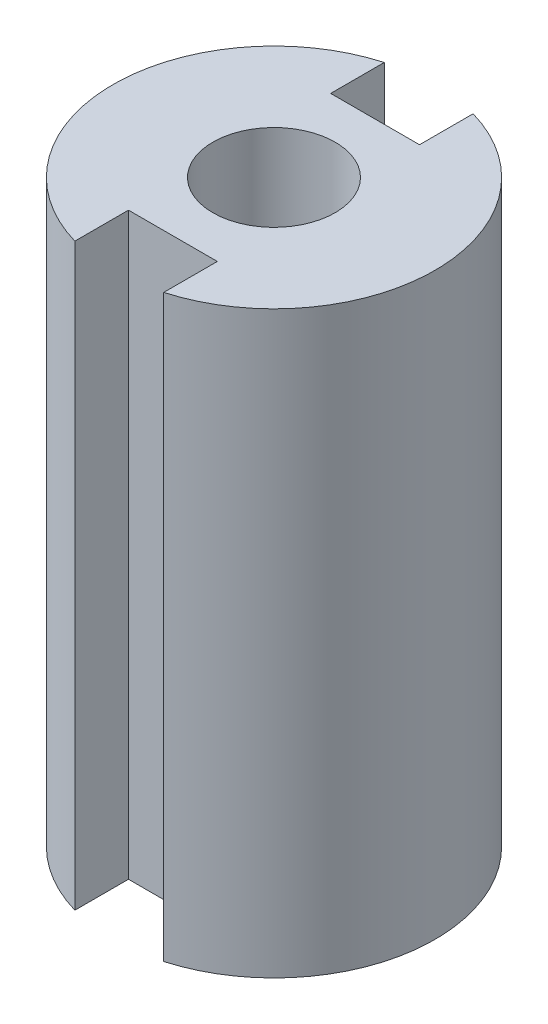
ISO-10303-21;
HEADER;
FILE_DESCRIPTION(('STEP AP214'),'2;1');
FILE_NAME('part.step','',(''),(''),'','','');
FILE_SCHEMA(('AUTOMOTIVE_DESIGN { 1 0 10303 214 1 1 1 1 }'));
ENDSEC;
DATA;
#1=APPLICATION_CONTEXT('core data for automotive mechanical design processes');
#2=APPLICATION_PROTOCOL_DEFINITION('international standard','automotive_design',2000,#1);
#3=PRODUCT_CONTEXT('',#1,'mechanical');
#4=PRODUCT('Part','Part','',(#3));
#5=PRODUCT_RELATED_PRODUCT_CATEGORY('part','',(#4));
#6=PRODUCT_DEFINITION_FORMATION('','',#4);
#7=PRODUCT_DEFINITION_CONTEXT('part definition',#1,'design');
#8=PRODUCT_DEFINITION('design','',#6,#7);
#9=PRODUCT_DEFINITION_SHAPE('','',#8);
#10=(LENGTH_UNIT() NAMED_UNIT(*) SI_UNIT(.MILLI.,.METRE.));
#11=(NAMED_UNIT(*) PLANE_ANGLE_UNIT() SI_UNIT($,.RADIAN.));
#12=(NAMED_UNIT(*) SI_UNIT($,.STERADIAN.) SOLID_ANGLE_UNIT());
#13=UNCERTAINTY_MEASURE_WITH_UNIT(LENGTH_MEASURE(1.E-05),#10,'distance_accuracy_value','');
#14=(GEOMETRIC_REPRESENTATION_CONTEXT(3) GLOBAL_UNCERTAINTY_ASSIGNED_CONTEXT((#13)) GLOBAL_UNIT_ASSIGNED_CONTEXT((#10,
#11,#12)) REPRESENTATION_CONTEXT('',''));
#15=CARTESIAN_POINT('',(0.,0.,0.));
#16=DIRECTION('',(0.,0.,1.));
#17=DIRECTION('',(1.,0.,0.));
#18=AXIS2_PLACEMENT_3D('',#15,#16,#17);
#19=CARTESIAN_POINT('',(0.,22.8599999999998,0.));
#20=DIRECTION('',(0.,-1.,0.));
#21=DIRECTION('',(0.,0.,-1.00000000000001));
#22=AXIS2_PLACEMENT_3D('',#19,#20,#21);
#23=CYLINDRICAL_SURFACE('',#22,6.35);
#24=CARTESIAN_POINT('',(0.,22.8599999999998,0.));
#25=DIRECTION('',(0.,1.,0.));
#26=DIRECTION('',(0.,0.,1.00000000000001));
#27=AXIS2_PLACEMENT_3D('',#24,#25,#26);
#28=CIRCLE('',#27,6.35);
#29=CARTESIAN_POINT('',(-1.75260000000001,22.8600000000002,-6.10335098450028));
#30=VERTEX_POINT('',#29);
#31=CARTESIAN_POINT('',(-1.75260000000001,22.86,6.10335098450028));
#32=VERTEX_POINT('',#31);
#33=EDGE_CURVE('E167',#30,#32,#28,.T.);
#34=ORIENTED_EDGE('',*,*,#33,.F.);
#35=DIRECTION('',(0.,-1.,0.));
#36=VECTOR('',#35,1.);
#37=CARTESIAN_POINT('',(-1.75260000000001,22.8600000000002,-6.10335098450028));
#38=LINE('',#37,#36);
#39=CARTESIAN_POINT('',(-1.75260000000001,2.28983498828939E-13,-6.10335098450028));
#40=VERTEX_POINT('',#39);
#41=EDGE_CURVE('E127',#30,#40,#38,.T.);
#42=ORIENTED_EDGE('',*,*,#41,.T.);
#43=CARTESIAN_POINT('',(0.,-2.22044604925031E-13,0.));
#44=DIRECTION('',(0.,1.,0.));
#45=DIRECTION('',(0.,0.,1.00000000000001));
#46=AXIS2_PLACEMENT_3D('',#43,#44,#45);
#47=CIRCLE('',#46,6.35);
#48=CARTESIAN_POINT('',(-1.75260000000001,0.,6.10335098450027));
#49=VERTEX_POINT('',#48);
#50=EDGE_CURVE('E163',#40,#49,#47,.T.);
#51=ORIENTED_EDGE('',*,*,#50,.T.);
#52=DIRECTION('',(0.,-1.,0.));
#53=VECTOR('',#52,1.);
#54=CARTESIAN_POINT('',(-1.75260000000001,22.86,6.10335098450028));
#55=LINE('',#54,#53);
#56=EDGE_CURVE('E145',#49,#32,#55,.F.);
#57=ORIENTED_EDGE('',*,*,#56,.T.);
#58=EDGE_LOOP('',(#34,#42,#51,#57));
#59=FACE_BOUND('',#58,.T.);
#60=ADVANCED_FACE('F30',(#59),#23,.T.);
#61=CARTESIAN_POINT('',(1.75259999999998,-2.22044604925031E-13,6.10335098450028));
#62=VERTEX_POINT('',#61);
#63=CARTESIAN_POINT('',(1.75259999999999,0.,-6.10335098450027));
#64=VERTEX_POINT('',#63);
#65=EDGE_CURVE('E164',#62,#64,#47,.T.);
#66=ORIENTED_EDGE('',*,*,#65,.T.);
#67=DIRECTION('',(0.,-1.,0.));
#68=VECTOR('',#67,1.);
#69=CARTESIAN_POINT('',(1.75259999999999,22.8600000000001,-6.10335098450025));
#70=LINE('',#69,#68);
#71=CARTESIAN_POINT('',(1.75259999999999,22.8600000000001,-6.10335098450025));
#72=VERTEX_POINT('',#71);
#73=EDGE_CURVE('E45',#64,#72,#70,.F.);
#74=ORIENTED_EDGE('',*,*,#73,.T.);
#75=CARTESIAN_POINT('',(1.75260000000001,22.86,6.10335098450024));
#76=VERTEX_POINT('',#75);
#77=EDGE_CURVE('E117',#76,#72,#28,.T.);
#78=ORIENTED_EDGE('',*,*,#77,.F.);
#79=DIRECTION('',(0.,-1.,0.));
#80=VECTOR('',#79,1.);
#81=CARTESIAN_POINT('',(1.75260000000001,22.86,6.10335098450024));
#82=LINE('',#81,#80);
#83=EDGE_CURVE('E150',#76,#62,#82,.T.);
#84=ORIENTED_EDGE('',*,*,#83,.T.);
#85=EDGE_LOOP('',(#66,#74,#78,#84));
#86=FACE_BOUND('',#85,.T.);
#87=ADVANCED_FACE('F32',(#86),#23,.T.);
#88=CARTESIAN_POINT('',(0.,22.8599999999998,0.));
#89=DIRECTION('',(0.,1.,0.));
#90=DIRECTION('',(0.,0.,1.00000000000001));
#91=AXIS2_PLACEMENT_3D('',#88,#89,#90);
#92=PLANE('',#91);
#93=DIRECTION('',(0.,0.,1.00000000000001));
#94=VECTOR('',#93,1.);
#95=CARTESIAN_POINT('',(-1.75260000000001,22.86,-3.9878));
#96=LINE('',#95,#94);
#97=CARTESIAN_POINT('',(-1.75260000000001,22.86,-3.9878));
#98=VERTEX_POINT('',#97);
#99=EDGE_CURVE('E118',#30,#98,#96,.T.);
#100=ORIENTED_EDGE('',*,*,#99,.F.);
#101=ORIENTED_EDGE('',*,*,#33,.T.);
#102=DIRECTION('',(0.,0.,1.00000000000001));
#103=VECTOR('',#102,1.);
#104=CARTESIAN_POINT('',(-1.75260000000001,22.8599999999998,3.9878));
#105=LINE('',#104,#103);
#106=CARTESIAN_POINT('',(-1.75260000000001,22.8599999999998,3.9878));
#107=VERTEX_POINT('',#106);
#108=EDGE_CURVE('E135',#107,#32,#105,.T.);
#109=ORIENTED_EDGE('',*,*,#108,.F.);
#110=DIRECTION('',(-1.00000000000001,0.,0.));
#111=VECTOR('',#110,1.);
#112=CARTESIAN_POINT('',(-1.75260000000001,22.8599999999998,3.9878));
#113=LINE('',#112,#111);
#114=CARTESIAN_POINT('',(1.75260000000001,22.86,3.98780000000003));
#115=VERTEX_POINT('',#114);
#116=EDGE_CURVE('E132',#115,#107,#113,.T.);
#117=ORIENTED_EDGE('',*,*,#116,.F.);
#118=DIRECTION('',(0.,0.,-1.00000000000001));
#119=VECTOR('',#118,1.);
#120=CARTESIAN_POINT('',(1.75260000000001,22.86,3.98780000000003));
#121=LINE('',#120,#119);
#122=EDGE_CURVE('E130',#76,#115,#121,.T.);
#123=ORIENTED_EDGE('',*,*,#122,.F.);
#124=ORIENTED_EDGE('',*,*,#77,.T.);
#125=DIRECTION('',(0.,0.,-1.00000000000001));
#126=VECTOR('',#125,1.);
#127=CARTESIAN_POINT('',(1.75259999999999,22.86,-3.98780000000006));
#128=LINE('',#127,#126);
#129=CARTESIAN_POINT('',(1.75259999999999,22.86,-3.98780000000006));
#130=VERTEX_POINT('',#129);
#131=EDGE_CURVE('E98',#130,#72,#128,.T.);
#132=ORIENTED_EDGE('',*,*,#131,.F.);
#133=DIRECTION('',(1.00000000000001,0.,0.));
#134=VECTOR('',#133,1.);
#135=CARTESIAN_POINT('',(-1.75260000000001,22.86,-3.9878));
#136=LINE('',#135,#134);
#137=EDGE_CURVE('E107',#98,#130,#136,.T.);
#138=ORIENTED_EDGE('',*,*,#137,.F.);
#139=EDGE_LOOP('',(#100,#101,#109,#117,#123,#124,#132,#138));
#140=FACE_BOUND('',#139,.T.);
#141=CARTESIAN_POINT('',(0.,22.8599999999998,0.));
#142=DIRECTION('',(0.,1.,0.));
#143=DIRECTION('',(0.,0.,1.00000000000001));
#144=AXIS2_PLACEMENT_3D('',#141,#142,#143);
#145=CIRCLE('',#144,2.413);
#146=CARTESIAN_POINT('',(0.,22.8599999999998,2.41300000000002));
#147=VERTEX_POINT('',#146);
#148=EDGE_CURVE('E157',#147,#147,#145,.T.);
#149=ORIENTED_EDGE('',*,*,#148,.F.);
#150=EDGE_LOOP('',(#149));
#151=FACE_BOUND('',#150,.T.);
#152=ADVANCED_FACE('F113',(#140,#151),#92,.T.);
#153=CARTESIAN_POINT('',(0.,-2.22044604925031E-13,0.));
#154=DIRECTION('',(0.,1.,0.));
#155=DIRECTION('',(0.,0.,1.00000000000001));
#156=AXIS2_PLACEMENT_3D('',#153,#154,#155);
#157=PLANE('',#156);
#158=ORIENTED_EDGE('',*,*,#50,.F.);
#159=DIRECTION('',(0.,0.,1.00000000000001));
#160=VECTOR('',#159,1.);
#161=CARTESIAN_POINT('',(-1.75260000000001,-2.22044604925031E-13,0.));
#162=LINE('',#161,#160);
#163=CARTESIAN_POINT('',(-1.75260000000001,-2.22044604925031E-13,-3.9878));
#164=VERTEX_POINT('',#163);
#165=EDGE_CURVE('E11',#40,#164,#162,.T.);
#166=ORIENTED_EDGE('',*,*,#165,.T.);
#167=DIRECTION('',(1.00000000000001,0.,0.));
#168=VECTOR('',#167,1.);
#169=CARTESIAN_POINT('',(-1.75260000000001,-2.22044604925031E-13,-3.9878));
#170=LINE('',#169,#168);
#171=CARTESIAN_POINT('',(1.75259999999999,0.,-3.9878));
#172=VERTEX_POINT('',#171);
#173=EDGE_CURVE('E120',#164,#172,#170,.T.);
#174=ORIENTED_EDGE('',*,*,#173,.T.);
#175=DIRECTION('',(0.,0.,-1.00000000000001));
#176=VECTOR('',#175,1.);
#177=CARTESIAN_POINT('',(1.75259999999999,0.,-3.9878));
#178=LINE('',#177,#176);
#179=EDGE_CURVE('E99',#172,#64,#178,.T.);
#180=ORIENTED_EDGE('',*,*,#179,.T.);
#181=ORIENTED_EDGE('',*,*,#65,.F.);
#182=DIRECTION('',(0.,0.,-1.00000000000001));
#183=VECTOR('',#182,1.);
#184=CARTESIAN_POINT('',(1.75260000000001,0.,0.));
#185=LINE('',#184,#183);
#186=CARTESIAN_POINT('',(1.75260000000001,0.,3.98780000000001));
#187=VERTEX_POINT('',#186);
#188=EDGE_CURVE('E38',#62,#187,#185,.T.);
#189=ORIENTED_EDGE('',*,*,#188,.T.);
#190=DIRECTION('',(-1.00000000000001,0.,0.));
#191=VECTOR('',#190,1.);
#192=CARTESIAN_POINT('',(-1.75259999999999,-2.22044604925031E-13,3.98779999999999));
#193=LINE('',#192,#191);
#194=CARTESIAN_POINT('',(-1.75259999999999,-2.22044604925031E-13,3.98779999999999));
#195=VERTEX_POINT('',#194);
#196=EDGE_CURVE('E138',#187,#195,#193,.T.);
#197=ORIENTED_EDGE('',*,*,#196,.T.);
#198=DIRECTION('',(0.,0.,1.00000000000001));
#199=VECTOR('',#198,1.);
#200=CARTESIAN_POINT('',(-1.75259999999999,-2.22044604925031E-13,3.98779999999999));
#201=LINE('',#200,#199);
#202=EDGE_CURVE('E53',#195,#49,#201,.T.);
#203=ORIENTED_EDGE('',*,*,#202,.T.);
#204=EDGE_LOOP('',(#158,#166,#174,#180,#181,#189,#197,#203));
#205=FACE_BOUND('',#204,.T.);
#206=CARTESIAN_POINT('',(0.,-2.22044604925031E-13,0.));
#207=DIRECTION('',(0.,-1.,0.));
#208=DIRECTION('',(0.,0.,-1.00000000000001));
#209=AXIS2_PLACEMENT_3D('',#206,#207,#208);
#210=CIRCLE('',#209,1.7272);
#211=CARTESIAN_POINT('',(0.,-2.22044604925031E-13,-1.72720000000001));
#212=VERTEX_POINT('',#211);
#213=EDGE_CURVE('E153',#212,#212,#210,.T.);
#214=ORIENTED_EDGE('',*,*,#213,.F.);
#215=EDGE_LOOP('',(#214));
#216=FACE_BOUND('',#215,.T.);
#217=ADVANCED_FACE('F174',(#205,#216),#157,.F.);
#218=CARTESIAN_POINT('',(0.,1.26999999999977,0.));
#219=DIRECTION('',(0.,1.,0.));
#220=DIRECTION('',(0.,0.,1.00000000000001));
#221=AXIS2_PLACEMENT_3D('',#218,#219,#220);
#222=CYLINDRICAL_SURFACE('',#221,2.413);
#223=CARTESIAN_POINT('',(0.,1.26999999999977,0.));
#224=DIRECTION('',(0.,1.,0.));
#225=DIRECTION('',(0.,0.,1.00000000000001));
#226=AXIS2_PLACEMENT_3D('',#223,#224,#225);
#227=CIRCLE('',#226,2.413);
#228=CARTESIAN_POINT('',(0.,1.26999999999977,2.41300000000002));
#229=VERTEX_POINT('',#228);
#230=EDGE_CURVE('E160',#229,#229,#227,.T.);
#231=ORIENTED_EDGE('',*,*,#230,.F.);
#232=EDGE_LOOP('',(#231));
#233=FACE_BOUND('',#232,.T.);
#234=ORIENTED_EDGE('',*,*,#148,.T.);
#235=EDGE_LOOP('',(#234));
#236=FACE_BOUND('',#235,.T.);
#237=ADVANCED_FACE('F215',(#233,#236),#222,.F.);
#238=CARTESIAN_POINT('',(0.,1.26999999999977,0.));
#239=DIRECTION('',(0.,1.,0.));
#240=DIRECTION('',(0.,0.,1.00000000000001));
#241=AXIS2_PLACEMENT_3D('',#238,#239,#240);
#242=PLANE('',#241);
#243=CARTESIAN_POINT('',(0.,1.26999999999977,0.));
#244=DIRECTION('',(0.,1.,0.));
#245=DIRECTION('',(0.,0.,1.00000000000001));
#246=AXIS2_PLACEMENT_3D('',#243,#244,#245);
#247=CIRCLE('',#246,1.7272);
#248=CARTESIAN_POINT('',(0.,1.26999999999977,1.72720000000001));
#249=VERTEX_POINT('',#248);
#250=EDGE_CURVE('E156',#249,#249,#247,.T.);
#251=ORIENTED_EDGE('',*,*,#250,.F.);
#252=EDGE_LOOP('',(#251));
#253=FACE_BOUND('',#252,.T.);
#254=ORIENTED_EDGE('',*,*,#230,.T.);
#255=EDGE_LOOP('',(#254));
#256=FACE_BOUND('',#255,.T.);
#257=ADVANCED_FACE('F211',(#253,#256),#242,.T.);
#258=CARTESIAN_POINT('',(0.,2.53999999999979,0.));
#259=DIRECTION('',(0.,-1.,0.));
#260=DIRECTION('',(0.,0.,-1.00000000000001));
#261=AXIS2_PLACEMENT_3D('',#258,#259,#260);
#262=CYLINDRICAL_SURFACE('',#261,1.7272);
#263=ORIENTED_EDGE('',*,*,#250,.T.);
#264=EDGE_LOOP('',(#263));
#265=FACE_BOUND('',#264,.T.);
#266=ORIENTED_EDGE('',*,*,#213,.T.);
#267=EDGE_LOOP('',(#266));
#268=FACE_BOUND('',#267,.T.);
#269=ADVANCED_FACE('F208',(#265,#268),#262,.F.);
#270=CARTESIAN_POINT('',(1.75260000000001,0.,3.98780000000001));
#271=DIRECTION('',(1.00000000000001,0.,0.));
#272=DIRECTION('',(0.,0.,-1.00000000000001));
#273=AXIS2_PLACEMENT_3D('',#270,#271,#272);
#274=PLANE('',#273);
#275=ORIENTED_EDGE('',*,*,#122,.T.);
#276=DIRECTION('',(0.,1.,0.));
#277=VECTOR('',#276,1.);
#278=CARTESIAN_POINT('',(1.75260000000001,0.,3.98780000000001));
#279=LINE('',#278,#277);
#280=EDGE_CURVE('E142',#187,#115,#279,.T.);
#281=ORIENTED_EDGE('',*,*,#280,.F.);
#282=ORIENTED_EDGE('',*,*,#188,.F.);
#283=ORIENTED_EDGE('',*,*,#83,.F.);
#284=EDGE_LOOP('',(#275,#281,#282,#283));
#285=FACE_BOUND('',#284,.T.);
#286=ADVANCED_FACE('F178',(#285),#274,.F.);
#287=CARTESIAN_POINT('',(-1.75259999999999,-2.22044604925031E-13,3.98779999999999));
#288=DIRECTION('',(-1.00000000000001,0.,0.));
#289=DIRECTION('',(0.,0.,1.00000000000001));
#290=AXIS2_PLACEMENT_3D('',#287,#288,#289);
#291=PLANE('',#290);
#292=ORIENTED_EDGE('',*,*,#202,.F.);
#293=DIRECTION('',(0.,1.,0.));
#294=VECTOR('',#293,1.);
#295=CARTESIAN_POINT('',(-1.75259999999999,-2.22044604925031E-13,3.98779999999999));
#296=LINE('',#295,#294);
#297=EDGE_CURVE('E143',#195,#107,#296,.T.);
#298=ORIENTED_EDGE('',*,*,#297,.T.);
#299=ORIENTED_EDGE('',*,*,#108,.T.);
#300=ORIENTED_EDGE('',*,*,#56,.F.);
#301=EDGE_LOOP('',(#292,#298,#299,#300));
#302=FACE_BOUND('',#301,.T.);
#303=ADVANCED_FACE('F191',(#302),#291,.F.);
#304=CARTESIAN_POINT('',(-1.75259999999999,-2.22044604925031E-13,3.98779999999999));
#305=DIRECTION('',(0.,0.,-1.00000000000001));
#306=DIRECTION('',(-1.00000000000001,0.,0.));
#307=AXIS2_PLACEMENT_3D('',#304,#305,#306);
#308=PLANE('',#307);
#309=ORIENTED_EDGE('',*,*,#116,.T.);
#310=ORIENTED_EDGE('',*,*,#297,.F.);
#311=ORIENTED_EDGE('',*,*,#196,.F.);
#312=ORIENTED_EDGE('',*,*,#280,.T.);
#313=EDGE_LOOP('',(#309,#310,#311,#312));
#314=FACE_BOUND('',#313,.T.);
#315=ADVANCED_FACE('F193',(#314),#308,.F.);
#316=CARTESIAN_POINT('',(-1.75260000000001,-2.22044604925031E-13,-3.9878));
#317=DIRECTION('',(-1.00000000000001,0.,0.));
#318=DIRECTION('',(0.,0.,1.00000000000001));
#319=AXIS2_PLACEMENT_3D('',#316,#317,#318);
#320=PLANE('',#319);
#321=ORIENTED_EDGE('',*,*,#99,.T.);
#322=DIRECTION('',(0.,1.,0.));
#323=VECTOR('',#322,1.);
#324=CARTESIAN_POINT('',(-1.75260000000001,-2.22044604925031E-13,-3.9878));
#325=LINE('',#324,#323);
#326=EDGE_CURVE('E103',#164,#98,#325,.T.);
#327=ORIENTED_EDGE('',*,*,#326,.F.);
#328=ORIENTED_EDGE('',*,*,#165,.F.);
#329=ORIENTED_EDGE('',*,*,#41,.F.);
#330=EDGE_LOOP('',(#321,#327,#328,#329));
#331=FACE_BOUND('',#330,.T.);
#332=ADVANCED_FACE('F195',(#331),#320,.F.);
#333=CARTESIAN_POINT('',(1.75259999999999,0.,-3.9878));
#334=DIRECTION('',(1.00000000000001,0.,0.));
#335=DIRECTION('',(0.,0.,-1.00000000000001));
#336=AXIS2_PLACEMENT_3D('',#333,#334,#335);
#337=PLANE('',#336);
#338=ORIENTED_EDGE('',*,*,#179,.F.);
#339=DIRECTION('',(0.,1.,0.));
#340=VECTOR('',#339,1.);
#341=CARTESIAN_POINT('',(1.75259999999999,0.,-3.9878));
#342=LINE('',#341,#340);
#343=EDGE_CURVE('E94',#172,#130,#342,.T.);
#344=ORIENTED_EDGE('',*,*,#343,.T.);
#345=ORIENTED_EDGE('',*,*,#131,.T.);
#346=ORIENTED_EDGE('',*,*,#73,.F.);
#347=EDGE_LOOP('',(#338,#344,#345,#346));
#348=FACE_BOUND('',#347,.T.);
#349=ADVANCED_FACE('F96',(#348),#337,.F.);
#350=CARTESIAN_POINT('',(-1.75260000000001,-2.22044604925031E-13,-3.9878));
#351=DIRECTION('',(0.,0.,1.00000000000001));
#352=DIRECTION('',(1.00000000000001,0.,0.));
#353=AXIS2_PLACEMENT_3D('',#350,#351,#352);
#354=PLANE('',#353);
#355=ORIENTED_EDGE('',*,*,#137,.T.);
#356=ORIENTED_EDGE('',*,*,#343,.F.);
#357=ORIENTED_EDGE('',*,*,#173,.F.);
#358=ORIENTED_EDGE('',*,*,#326,.T.);
#359=EDGE_LOOP('',(#355,#356,#357,#358));
#360=FACE_BOUND('',#359,.T.);
#361=ADVANCED_FACE('F108',(#360),#354,.F.);
#362=CLOSED_SHELL('',(#60,#87,#152,#217,#237,#257,#269,#286,#303,#315,#332,#349,#361));
#363=MANIFOLD_SOLID_BREP('B2',#362);
#364=ADVANCED_BREP_SHAPE_REPRESENTATION('',(#18,#363),#14);
#365=SHAPE_DEFINITION_REPRESENTATION(#9,#364);
ENDSEC;
END-ISO-10303-21;
